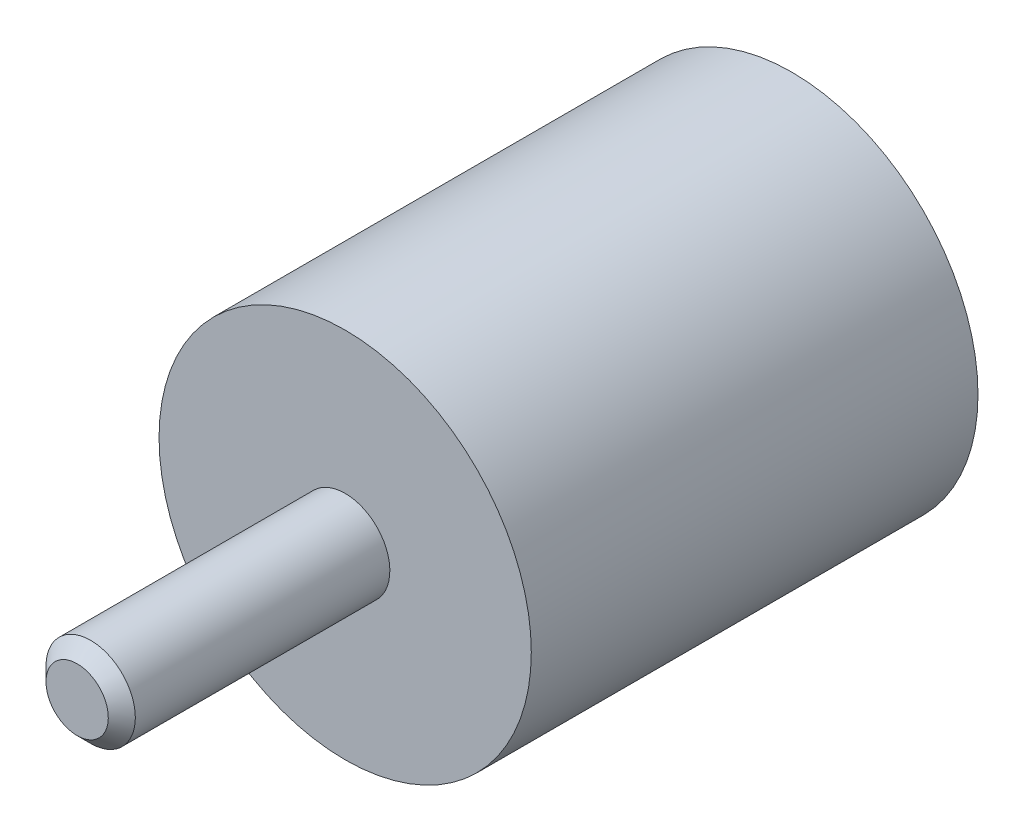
ISO-10303-21;
HEADER;
FILE_DESCRIPTION(('STEP AP214'),'2;1');
FILE_NAME('part.step','',(''),(''),'','','');
FILE_SCHEMA(('AUTOMOTIVE_DESIGN { 1 0 10303 214 1 1 1 1 }'));
ENDSEC;
DATA;
#1=APPLICATION_CONTEXT('core data for automotive mechanical design processes');
#2=APPLICATION_PROTOCOL_DEFINITION('international standard','automotive_design',2000,#1);
#3=PRODUCT_CONTEXT('',#1,'mechanical');
#4=PRODUCT('Part','Part','',(#3));
#5=PRODUCT_RELATED_PRODUCT_CATEGORY('part','',(#4));
#6=PRODUCT_DEFINITION_FORMATION('','',#4);
#7=PRODUCT_DEFINITION_CONTEXT('part definition',#1,'design');
#8=PRODUCT_DEFINITION('design','',#6,#7);
#9=PRODUCT_DEFINITION_SHAPE('','',#8);
#10=(LENGTH_UNIT() NAMED_UNIT(*) SI_UNIT(.MILLI.,.METRE.));
#11=(NAMED_UNIT(*) PLANE_ANGLE_UNIT() SI_UNIT($,.RADIAN.));
#12=(NAMED_UNIT(*) SI_UNIT($,.STERADIAN.) SOLID_ANGLE_UNIT());
#13=UNCERTAINTY_MEASURE_WITH_UNIT(LENGTH_MEASURE(1.E-05),#10,'distance_accuracy_value','');
#14=(GEOMETRIC_REPRESENTATION_CONTEXT(3) GLOBAL_UNCERTAINTY_ASSIGNED_CONTEXT((#13)) GLOBAL_UNIT_ASSIGNED_CONTEXT((#10,
#11,#12)) REPRESENTATION_CONTEXT('',''));
#15=CARTESIAN_POINT('',(0.,0.,0.));
#16=DIRECTION('',(0.,0.,1.));
#17=DIRECTION('',(1.,0.,0.));
#18=AXIS2_PLACEMENT_3D('',#15,#16,#17);
#19=CARTESIAN_POINT('',(0.,0.,0.));
#20=DIRECTION('',(0.,0.,1.));
#21=DIRECTION('',(0.,-1.,0.));
#22=AXIS2_PLACEMENT_3D('',#19,#20,#21);
#23=CYLINDRICAL_SURFACE('',#22,12.5);
#24=CARTESIAN_POINT('',(0.,0.,0.));
#25=DIRECTION('',(0.,0.,1.));
#26=DIRECTION('',(0.,-1.,0.));
#27=AXIS2_PLACEMENT_3D('',#24,#25,#26);
#28=CIRCLE('',#27,12.5);
#29=CARTESIAN_POINT('',(0.,-12.5,0.));
#30=VERTEX_POINT('',#29);
#31=EDGE_CURVE('E18',#30,#30,#28,.T.);
#32=ORIENTED_EDGE('',*,*,#31,.T.);
#33=EDGE_LOOP('',(#32));
#34=FACE_BOUND('',#33,.T.);
#35=CARTESIAN_POINT('',(0.,0.,30.));
#36=DIRECTION('',(0.,0.,-1.));
#37=DIRECTION('',(0.,1.,0.));
#38=AXIS2_PLACEMENT_3D('',#35,#36,#37);
#39=CIRCLE('',#38,12.5);
#40=CARTESIAN_POINT('',(0.,12.5,30.));
#41=VERTEX_POINT('',#40);
#42=EDGE_CURVE('E22',#41,#41,#39,.T.);
#43=ORIENTED_EDGE('',*,*,#42,.T.);
#44=EDGE_LOOP('',(#43));
#45=FACE_BOUND('',#44,.T.);
#46=ADVANCED_FACE('F12',(#34,#45),#23,.T.);
#47=CARTESIAN_POINT('',(12.5,0.,0.));
#48=DIRECTION('',(0.,0.,-1.));
#49=DIRECTION('',(0.,1.,0.));
#50=AXIS2_PLACEMENT_3D('',#47,#48,#49);
#51=PLANE('',#50);
#52=ORIENTED_EDGE('',*,*,#31,.F.);
#53=EDGE_LOOP('',(#52));
#54=FACE_BOUND('',#53,.T.);
#55=ADVANCED_FACE('F48',(#54),#51,.T.);
#56=CARTESIAN_POINT('',(12.5,0.,30.));
#57=DIRECTION('',(0.,0.,1.));
#58=DIRECTION('',(0.,-1.,0.));
#59=AXIS2_PLACEMENT_3D('',#56,#57,#58);
#60=PLANE('',#59);
#61=CARTESIAN_POINT('',(0.,0.,30.));
#62=DIRECTION('',(0.,0.,1.));
#63=DIRECTION('',(0.,-1.,0.));
#64=AXIS2_PLACEMENT_3D('',#61,#62,#63);
#65=CIRCLE('',#64,3.);
#66=CARTESIAN_POINT('',(0.,-3.,30.));
#67=VERTEX_POINT('',#66);
#68=EDGE_CURVE('E8',#67,#67,#65,.F.);
#69=ORIENTED_EDGE('',*,*,#68,.T.);
#70=EDGE_LOOP('',(#69));
#71=FACE_BOUND('',#70,.T.);
#72=ORIENTED_EDGE('',*,*,#42,.F.);
#73=EDGE_LOOP('',(#72));
#74=FACE_BOUND('',#73,.T.);
#75=ADVANCED_FACE('F52',(#71,#74),#60,.T.);
#76=CARTESIAN_POINT('',(0.,0.,15.));
#77=DIRECTION('',(0.,0.,1.));
#78=DIRECTION('',(0.,-1.,0.));
#79=AXIS2_PLACEMENT_3D('',#76,#77,#78);
#80=CYLINDRICAL_SURFACE('',#79,3.);
#81=ORIENTED_EDGE('',*,*,#68,.F.);
#82=EDGE_LOOP('',(#81));
#83=FACE_BOUND('',#82,.T.);
#84=CARTESIAN_POINT('',(0.,0.,47.0920477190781));
#85=DIRECTION('',(0.,0.,-1.));
#86=DIRECTION('',(0.,1.,0.));
#87=AXIS2_PLACEMENT_3D('',#84,#85,#86);
#88=CIRCLE('',#87,3.);
#89=CARTESIAN_POINT('',(0.,3.,47.0920477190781));
#90=VERTEX_POINT('',#89);
#91=EDGE_CURVE('E26',#90,#90,#88,.T.);
#92=ORIENTED_EDGE('',*,*,#91,.T.);
#93=EDGE_LOOP('',(#92));
#94=FACE_BOUND('',#93,.T.);
#95=ADVANCED_FACE('F45',(#83,#94),#80,.T.);
#96=CARTESIAN_POINT('',(0.,0.,47.0920477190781));
#97=DIRECTION('',(0.,0.,-1.));
#98=DIRECTION('',(0.,1.,0.));
#99=AXIS2_PLACEMENT_3D('',#96,#97,#98);
#100=CONICAL_SURFACE('',#99,3.,0.785398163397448);
#101=CARTESIAN_POINT('',(0.,0.,48.));
#102=DIRECTION('',(0.,0.,-1.));
#103=DIRECTION('',(0.,1.,0.));
#104=AXIS2_PLACEMENT_3D('',#101,#102,#103);
#105=CIRCLE('',#104,2.09204771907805);
#106=CARTESIAN_POINT('',(0.,2.09204771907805,48.));
#107=VERTEX_POINT('',#106);
#108=EDGE_CURVE('E31',#107,#107,#105,.T.);
#109=ORIENTED_EDGE('',*,*,#108,.T.);
#110=EDGE_LOOP('',(#109));
#111=FACE_BOUND('',#110,.T.);
#112=ORIENTED_EDGE('',*,*,#91,.F.);
#113=EDGE_LOOP('',(#112));
#114=FACE_BOUND('',#113,.T.);
#115=ADVANCED_FACE('F35',(#111,#114),#100,.T.);
#116=CARTESIAN_POINT('',(2.09204771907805,0.,48.));
#117=DIRECTION('',(0.,0.,1.));
#118=DIRECTION('',(0.,-1.,0.));
#119=AXIS2_PLACEMENT_3D('',#116,#117,#118);
#120=PLANE('',#119);
#121=ORIENTED_EDGE('',*,*,#108,.F.);
#122=EDGE_LOOP('',(#121));
#123=FACE_BOUND('',#122,.T.);
#124=ADVANCED_FACE('F38',(#123),#120,.T.);
#125=CLOSED_SHELL('',(#46,#55,#75,#95,#115,#124));
#126=MANIFOLD_SOLID_BREP('B1',#125);
#127=ADVANCED_BREP_SHAPE_REPRESENTATION('',(#18,#126),#14);
#128=SHAPE_DEFINITION_REPRESENTATION(#9,#127);
ENDSEC;
END-ISO-10303-21;
